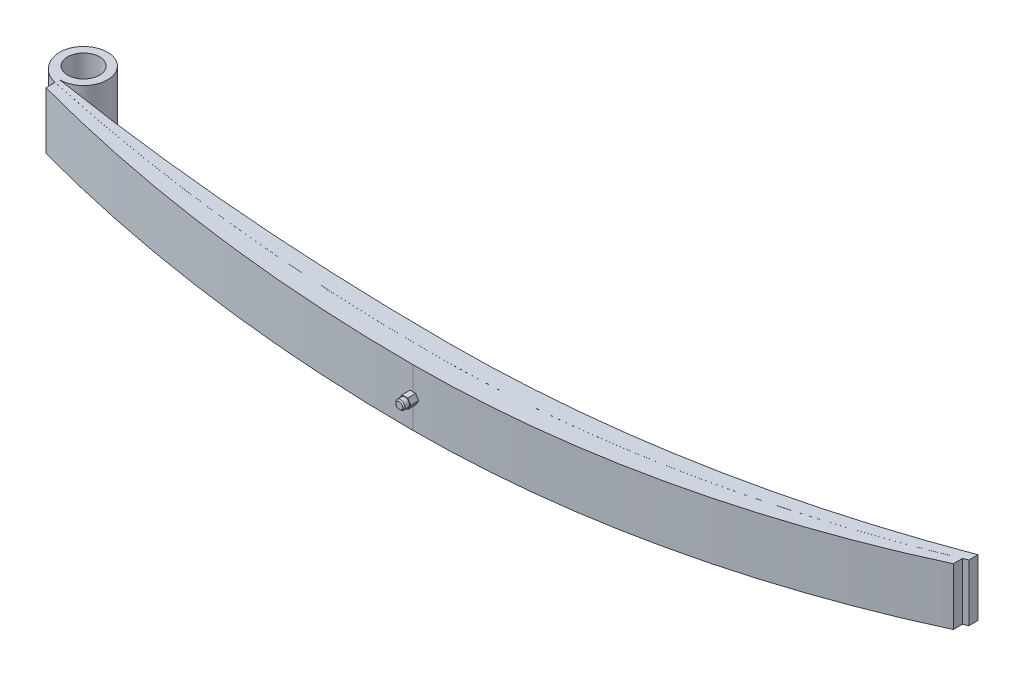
ISO-10303-21;
HEADER;
FILE_DESCRIPTION(('STEP AP214'),'2;1');
FILE_NAME('part.step','',(''),(''),'','','');
FILE_SCHEMA(('AUTOMOTIVE_DESIGN { 1 0 10303 214 1 1 1 1 }'));
ENDSEC;
DATA;
#1=APPLICATION_CONTEXT('core data for automotive mechanical design processes');
#2=APPLICATION_PROTOCOL_DEFINITION('international standard','automotive_design',2000,#1);
#3=PRODUCT_CONTEXT('',#1,'mechanical');
#4=PRODUCT('Part','Part','',(#3));
#5=PRODUCT_RELATED_PRODUCT_CATEGORY('part','',(#4));
#6=PRODUCT_DEFINITION_FORMATION('','',#4);
#7=PRODUCT_DEFINITION_CONTEXT('part definition',#1,'design');
#8=PRODUCT_DEFINITION('design','',#6,#7);
#9=PRODUCT_DEFINITION_SHAPE('','',#8);
#10=(LENGTH_UNIT() NAMED_UNIT(*) SI_UNIT(.MILLI.,.METRE.));
#11=(NAMED_UNIT(*) PLANE_ANGLE_UNIT() SI_UNIT($,.RADIAN.));
#12=(NAMED_UNIT(*) SI_UNIT($,.STERADIAN.) SOLID_ANGLE_UNIT());
#13=UNCERTAINTY_MEASURE_WITH_UNIT(LENGTH_MEASURE(1.E-05),#10,'distance_accuracy_value','');
#14=(GEOMETRIC_REPRESENTATION_CONTEXT(3) GLOBAL_UNCERTAINTY_ASSIGNED_CONTEXT((#13)) GLOBAL_UNIT_ASSIGNED_CONTEXT((#10,
#11,#12)) REPRESENTATION_CONTEXT('',''));
#15=CARTESIAN_POINT('',(0.,0.,0.));
#16=DIRECTION('',(0.,0.,1.));
#17=DIRECTION('',(1.,0.,0.));
#18=AXIS2_PLACEMENT_3D('',#15,#16,#17);
#19=CARTESIAN_POINT('',(371.499999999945,-25.,-954.999999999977));
#20=DIRECTION('',(0.,1.,0.));
#21=DIRECTION('',(0.,0.,1.));
#22=AXIS2_PLACEMENT_3D('',#19,#20,#21);
#23=CYLINDRICAL_SURFACE('',#22,1020.5);
#24=CARTESIAN_POINT('',(371.499999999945,-4.3301270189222,-954.999999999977));
#25=DIRECTION('',(0.,1.,0.));
#26=DIRECTION('',(0.,0.,1.));
#27=AXIS2_PLACEMENT_3D('',#24,#25,#26);
#28=CIRCLE('',#27,1020.5);
#29=CARTESIAN_POINT('',(371.499999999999,-4.3301270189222,65.5000000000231));
#30=VERTEX_POINT('',#29);
#31=CARTESIAN_POINT('',(374.,-4.3301270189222,65.4969377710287));
#32=VERTEX_POINT('',#31);
#33=EDGE_CURVE('E291',#30,#32,#28,.T.);
#34=ORIENTED_EDGE('',*,*,#33,.F.);
#35=DIRECTION('',(0.,1.,0.));
#36=VECTOR('',#35,1.);
#37=CARTESIAN_POINT('',(371.499999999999,-25.,65.5000000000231));
#38=LINE('',#37,#36);
#39=CARTESIAN_POINT('',(371.499999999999,-25.,65.5000000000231));
#40=VERTEX_POINT('',#39);
#41=EDGE_CURVE('E486',#40,#30,#38,.T.);
#42=ORIENTED_EDGE('',*,*,#41,.F.);
#43=CARTESIAN_POINT('',(371.499999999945,-25.,-954.999999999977));
#44=DIRECTION('',(0.,-1.,0.));
#45=DIRECTION('',(1.,0.,0.));
#46=AXIS2_PLACEMENT_3D('',#43,#44,#45);
#47=CIRCLE('',#46,1020.5);
#48=CARTESIAN_POINT('',(764.,-25.,-13.));
#49=VERTEX_POINT('',#48);
#50=EDGE_CURVE('E485',#49,#40,#47,.T.);
#51=ORIENTED_EDGE('',*,*,#50,.F.);
#52=DIRECTION('',(0.,1.,0.));
#53=VECTOR('',#52,1.);
#54=CARTESIAN_POINT('',(764.,-25.,-13.));
#55=LINE('',#54,#53);
#56=CARTESIAN_POINT('',(764.,25.,-13.));
#57=VERTEX_POINT('',#56);
#58=EDGE_CURVE('E471',#49,#57,#55,.T.);
#59=ORIENTED_EDGE('',*,*,#58,.T.);
#60=CARTESIAN_POINT('',(371.499999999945,25.,-954.999999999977));
#61=DIRECTION('',(0.,-1.,0.));
#62=DIRECTION('',(1.,0.,0.));
#63=AXIS2_PLACEMENT_3D('',#60,#61,#62);
#64=CIRCLE('',#63,1020.5);
#65=CARTESIAN_POINT('',(371.499999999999,25.,65.5000000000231));
#66=VERTEX_POINT('',#65);
#67=EDGE_CURVE('E479',#57,#66,#64,.T.);
#68=ORIENTED_EDGE('',*,*,#67,.T.);
#69=CARTESIAN_POINT('',(371.499999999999,4.33012701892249,65.5000000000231));
#70=VERTEX_POINT('',#69);
#71=EDGE_CURVE('E530',#70,#66,#38,.T.);
#72=ORIENTED_EDGE('',*,*,#71,.F.);
#73=CARTESIAN_POINT('',(371.499999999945,4.33012701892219,-954.999999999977));
#74=DIRECTION('',(0.,-1.,0.));
#75=DIRECTION('',(1.,0.,0.));
#76=AXIS2_PLACEMENT_3D('',#73,#74,#75);
#77=CIRCLE('',#76,1020.5);
#78=CARTESIAN_POINT('',(374.,4.33012701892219,65.4969377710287));
#79=VERTEX_POINT('',#78);
#80=EDGE_CURVE('E273',#79,#70,#77,.T.);
#81=ORIENTED_EDGE('',*,*,#80,.F.);
#82=CARTESIAN_POINT('',(371.499999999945,8.66025403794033,-954.999999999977));
#83=DIRECTION('',(-0.866025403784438,-0.500000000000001,0.));
#84=DIRECTION('',(-0.500000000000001,0.866025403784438,0.));
#85=AXIS2_PLACEMENT_3D('',#82,#83,#84);
#86=ELLIPSE('',#85,2041.,1020.5);
#87=CARTESIAN_POINT('',(376.5,0.,65.4877510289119));
#88=VERTEX_POINT('',#87);
#89=EDGE_CURVE('E35',#88,#79,#86,.T.);
#90=ORIENTED_EDGE('',*,*,#89,.F.);
#91=CARTESIAN_POINT('',(371.499999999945,-8.66025403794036,-954.999999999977));
#92=DIRECTION('',(-0.866025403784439,0.499999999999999,0.));
#93=DIRECTION('',(0.499999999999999,0.866025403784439,0.));
#94=AXIS2_PLACEMENT_3D('',#91,#92,#93);
#95=ELLIPSE('',#94,2041.,1020.5);
#96=EDGE_CURVE('E30',#32,#88,#95,.T.);
#97=ORIENTED_EDGE('',*,*,#96,.F.);
#98=EDGE_LOOP('',(#34,#42,#51,#59,#68,#72,#81,#90,#97));
#99=FACE_BOUND('',#98,.T.);
#100=ADVANCED_FACE('F15',(#99),#23,.T.);
#101=CARTESIAN_POINT('',(371.500000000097,-25.,-1658.60493827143));
#102=DIRECTION('',(0.,1.,0.));
#103=DIRECTION('',(0.,0.,1.));
#104=AXIS2_PLACEMENT_3D('',#101,#102,#103);
#105=CYLINDRICAL_SURFACE('',#104,1724.10493827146);
#106=CARTESIAN_POINT('',(371.500000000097,-4.3301270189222,-1658.60493827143));
#107=DIRECTION('',(0.,1.,0.));
#108=DIRECTION('',(0.,0.,1.));
#109=AXIS2_PLACEMENT_3D('',#106,#107,#108);
#110=CIRCLE('',#109,1724.10493827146);
#111=CARTESIAN_POINT('',(369.,-4.3301270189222,65.4981874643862));
#112=VERTEX_POINT('',#111);
#113=EDGE_CURVE('E288',#112,#30,#110,.T.);
#114=ORIENTED_EDGE('',*,*,#113,.F.);
#115=CARTESIAN_POINT('',(371.500000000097,-8.66025403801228,-1658.60493827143));
#116=DIRECTION('',(0.866025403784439,0.5,0.));
#117=DIRECTION('',(-0.5,0.866025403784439,0.));
#118=AXIS2_PLACEMENT_3D('',#115,#116,#117);
#119=ELLIPSE('',#118,3448.20987654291,1724.10493827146);
#120=CARTESIAN_POINT('',(366.5,0.,65.4927498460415));
#121=VERTEX_POINT('',#120);
#122=EDGE_CURVE('E296',#121,#112,#119,.T.);
#123=ORIENTED_EDGE('',*,*,#122,.F.);
#124=CARTESIAN_POINT('',(371.500000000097,8.66025403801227,-1658.60493827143));
#125=DIRECTION('',(0.866025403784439,-0.5,0.));
#126=DIRECTION('',(0.5,0.866025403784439,0.));
#127=AXIS2_PLACEMENT_3D('',#124,#125,#126);
#128=ELLIPSE('',#127,3448.20987654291,1724.10493827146);
#129=CARTESIAN_POINT('',(369.,4.33012701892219,65.4981874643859));
#130=VERTEX_POINT('',#129);
#131=EDGE_CURVE('E302',#130,#121,#128,.T.);
#132=ORIENTED_EDGE('',*,*,#131,.F.);
#133=CARTESIAN_POINT('',(371.500000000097,4.33012701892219,-1658.60493827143));
#134=DIRECTION('',(0.,-1.,0.));
#135=DIRECTION('',(1.,0.,0.));
#136=AXIS2_PLACEMENT_3D('',#133,#134,#135);
#137=CIRCLE('',#136,1724.10493827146);
#138=EDGE_CURVE('E270',#70,#130,#137,.T.);
#139=ORIENTED_EDGE('',*,*,#138,.F.);
#140=ORIENTED_EDGE('',*,*,#71,.T.);
#141=CARTESIAN_POINT('',(371.500000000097,25.,-1658.60493827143));
#142=DIRECTION('',(0.,-1.,0.));
#143=DIRECTION('',(1.,0.,0.));
#144=AXIS2_PLACEMENT_3D('',#141,#142,#143);
#145=CIRCLE('',#144,1724.10493827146);
#146=CARTESIAN_POINT('',(0.111059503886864,25.,25.0245022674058));
#147=VERTEX_POINT('',#146);
#148=EDGE_CURVE('E491',#66,#147,#145,.T.);
#149=ORIENTED_EDGE('',*,*,#148,.T.);
#150=DIRECTION('',(0.,1.,0.));
#151=VECTOR('',#150,1.);
#152=CARTESIAN_POINT('',(0.111059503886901,-25.,25.0245022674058));
#153=LINE('',#152,#151);
#154=CARTESIAN_POINT('',(0.111059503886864,-25.,25.0245022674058));
#155=VERTEX_POINT('',#154);
#156=EDGE_CURVE('E396',#147,#155,#153,.F.);
#157=ORIENTED_EDGE('',*,*,#156,.T.);
#158=CARTESIAN_POINT('',(371.500000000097,-25.,-1658.60493827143));
#159=DIRECTION('',(0.,-1.,0.));
#160=DIRECTION('',(1.,0.,0.));
#161=AXIS2_PLACEMENT_3D('',#158,#159,#160);
#162=CIRCLE('',#161,1724.10493827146);
#163=EDGE_CURVE('E693',#40,#155,#162,.T.);
#164=ORIENTED_EDGE('',*,*,#163,.F.);
#165=ORIENTED_EDGE('',*,*,#41,.T.);
#166=EDGE_LOOP('',(#114,#123,#132,#139,#140,#149,#157,#164,#165));
#167=FACE_BOUND('',#166,.T.);
#168=ADVANCED_FACE('F456',(#167),#105,.T.);
#169=CARTESIAN_POINT('',(371.500000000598,25.,-1658.60493827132));
#170=DIRECTION('',(0.,-1.,0.));
#171=DIRECTION('',(0.,0.,-1.));
#172=AXIS2_PLACEMENT_3D('',#169,#170,#171);
#173=CYLINDRICAL_SURFACE('',#172,1724.15493827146);
#174=CARTESIAN_POINT('',(371.500000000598,-8.66025403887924,-1658.60493827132));
#175=DIRECTION('',(0.866025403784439,0.5,0.));
#176=DIRECTION('',(0.5,-0.866025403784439,0.));
#177=AXIS2_PLACEMENT_3D('',#174,#175,#176);
#178=ELLIPSE('',#177,3448.30987654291,1724.15493827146);
#179=CARTESIAN_POINT('',(366.5,0.,65.542750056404));
#180=VERTEX_POINT('',#179);
#181=CARTESIAN_POINT('',(369.,-4.3301270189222,65.5481875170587));
#182=VERTEX_POINT('',#181);
#183=EDGE_CURVE('E293',#180,#182,#178,.T.);
#184=ORIENTED_EDGE('',*,*,#183,.T.);
#185=CARTESIAN_POINT('',(371.500000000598,-4.3301270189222,-1658.60493827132));
#186=DIRECTION('',(0.,1.,0.));
#187=DIRECTION('',(0.,0.,1.));
#188=AXIS2_PLACEMENT_3D('',#185,#186,#187);
#189=CIRCLE('',#188,1724.15493827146);
#190=CARTESIAN_POINT('',(371.500000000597,-4.3301270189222,65.5500000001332));
#191=VERTEX_POINT('',#190);
#192=EDGE_CURVE('E285',#182,#191,#189,.T.);
#193=ORIENTED_EDGE('',*,*,#192,.T.);
#194=DIRECTION('',(0.,-1.,0.));
#195=VECTOR('',#194,1.);
#196=CARTESIAN_POINT('',(371.500000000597,25.,65.5500000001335));
#197=LINE('',#196,#195);
#198=CARTESIAN_POINT('',(371.500000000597,-25.,65.5500000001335));
#199=VERTEX_POINT('',#198);
#200=EDGE_CURVE('E387',#191,#199,#197,.T.);
#201=ORIENTED_EDGE('',*,*,#200,.T.);
#202=CARTESIAN_POINT('',(371.500000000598,-25.,-1658.60493827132));
#203=DIRECTION('',(0.,1.,0.));
#204=DIRECTION('',(0.,0.,-1.));
#205=AXIS2_PLACEMENT_3D('',#202,#203,#204);
#206=CIRCLE('',#205,1724.15493827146);
#207=CARTESIAN_POINT('',(0.450328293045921,-25.,25.1505048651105));
#208=VERTEX_POINT('',#207);
#209=EDGE_CURVE('E348',#208,#199,#206,.T.);
#210=ORIENTED_EDGE('',*,*,#209,.F.);
#211=DIRECTION('',(0.,-1.,0.));
#212=VECTOR('',#211,1.);
#213=CARTESIAN_POINT('',(0.450328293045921,25.,25.1505048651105));
#214=LINE('',#213,#212);
#215=CARTESIAN_POINT('',(0.450328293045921,25.,25.1505048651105));
#216=VERTEX_POINT('',#215);
#217=EDGE_CURVE('E391',#216,#208,#214,.T.);
#218=ORIENTED_EDGE('',*,*,#217,.F.);
#219=CARTESIAN_POINT('',(371.500000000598,25.,-1658.60493827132));
#220=DIRECTION('',(0.,1.,0.));
#221=DIRECTION('',(0.,0.,-1.));
#222=AXIS2_PLACEMENT_3D('',#219,#220,#221);
#223=CIRCLE('',#222,1724.15493827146);
#224=CARTESIAN_POINT('',(371.500000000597,25.,65.5500000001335));
#225=VERTEX_POINT('',#224);
#226=EDGE_CURVE('E320',#216,#225,#223,.T.);
#227=ORIENTED_EDGE('',*,*,#226,.T.);
#228=CARTESIAN_POINT('',(371.500000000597,4.33012701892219,65.5500000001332));
#229=VERTEX_POINT('',#228);
#230=EDGE_CURVE('E388',#225,#229,#197,.T.);
#231=ORIENTED_EDGE('',*,*,#230,.T.);
#232=CARTESIAN_POINT('',(371.500000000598,4.33012701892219,-1658.60493827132));
#233=DIRECTION('',(0.,-1.,0.));
#234=DIRECTION('',(1.,0.,0.));
#235=AXIS2_PLACEMENT_3D('',#232,#233,#234);
#236=CIRCLE('',#235,1724.15493827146);
#237=CARTESIAN_POINT('',(369.,4.33012701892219,65.5481875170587));
#238=VERTEX_POINT('',#237);
#239=EDGE_CURVE('E267',#229,#238,#236,.T.);
#240=ORIENTED_EDGE('',*,*,#239,.T.);
#241=CARTESIAN_POINT('',(371.500000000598,8.66025403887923,-1658.60493827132));
#242=DIRECTION('',(0.866025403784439,-0.5,0.));
#243=DIRECTION('',(-0.5,-0.866025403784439,0.));
#244=AXIS2_PLACEMENT_3D('',#241,#242,#243);
#245=ELLIPSE('',#244,3448.30987654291,1724.15493827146);
#246=EDGE_CURVE('E299',#238,#180,#245,.T.);
#247=ORIENTED_EDGE('',*,*,#246,.T.);
#248=EDGE_LOOP('',(#184,#193,#201,#210,#218,#227,#231,#240,#247));
#249=FACE_BOUND('',#248,.T.);
#250=ADVANCED_FACE('F459',(#249),#173,.F.);
#251=CARTESIAN_POINT('',(371.499999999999,25.,65.5500000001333));
#252=DIRECTION('',(-0.000265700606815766,0.,-0.999999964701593));
#253=DIRECTION('',(-0.999999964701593,0.,0.000265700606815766));
#254=AXIS2_PLACEMENT_3D('',#251,#252,#253);
#255=PLANE('',#254);
#256=ORIENTED_EDGE('',*,*,#200,.F.);
#257=DIRECTION('',(0.999999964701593,0.,-0.000265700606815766));
#258=VECTOR('',#257,1.);
#259=CARTESIAN_POINT('',(371.499999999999,-4.3301270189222,65.5500000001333));
#260=LINE('',#259,#258);
#261=CARTESIAN_POINT('',(372.042321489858,-4.3301270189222,65.5498559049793));
#262=VERTEX_POINT('',#261);
#263=EDGE_CURVE('E282',#191,#262,#260,.T.);
#264=ORIENTED_EDGE('',*,*,#263,.T.);
#265=DIRECTION('',(0.,-1.,0.));
#266=VECTOR('',#265,1.);
#267=CARTESIAN_POINT('',(372.042321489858,25.,65.5498559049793));
#268=LINE('',#267,#266);
#269=CARTESIAN_POINT('',(372.042321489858,-25.,65.5498559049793));
#270=VERTEX_POINT('',#269);
#271=EDGE_CURVE('E383',#262,#270,#268,.T.);
#272=ORIENTED_EDGE('',*,*,#271,.T.);
#273=DIRECTION('',(0.999999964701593,0.,-0.000265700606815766));
#274=VECTOR('',#273,1.);
#275=CARTESIAN_POINT('',(371.499999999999,-25.,65.5500000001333));
#276=LINE('',#275,#274);
#277=EDGE_CURVE('E352',#199,#270,#276,.T.);
#278=ORIENTED_EDGE('',*,*,#277,.F.);
#279=EDGE_LOOP('',(#256,#264,#272,#278));
#280=FACE_BOUND('',#279,.T.);
#281=ADVANCED_FACE('F575',(#280),#255,.T.);
#282=CARTESIAN_POINT('',(372.042321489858,25.,65.5498559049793));
#283=VERTEX_POINT('',#282);
#284=CARTESIAN_POINT('',(372.042321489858,4.33012701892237,65.5498559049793));
#285=VERTEX_POINT('',#284);
#286=EDGE_CURVE('E384',#283,#285,#268,.T.);
#287=ORIENTED_EDGE('',*,*,#286,.T.);
#288=DIRECTION('',(-0.999999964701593,0.,0.000265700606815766));
#289=VECTOR('',#288,1.);
#290=CARTESIAN_POINT('',(371.499999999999,4.33012701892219,65.5500000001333));
#291=LINE('',#290,#289);
#292=EDGE_CURVE('E264',#285,#229,#291,.T.);
#293=ORIENTED_EDGE('',*,*,#292,.T.);
#294=ORIENTED_EDGE('',*,*,#230,.F.);
#295=DIRECTION('',(0.999999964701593,0.,-0.000265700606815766));
#296=VECTOR('',#295,1.);
#297=CARTESIAN_POINT('',(371.499999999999,25.,65.5500000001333));
#298=LINE('',#297,#296);
#299=EDGE_CURVE('E323',#225,#283,#298,.T.);
#300=ORIENTED_EDGE('',*,*,#299,.T.);
#301=EDGE_LOOP('',(#287,#293,#294,#300));
#302=FACE_BOUND('',#301,.T.);
#303=ADVANCED_FACE('F667',(#302),#255,.T.);
#304=CARTESIAN_POINT('',(371.499999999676,25.,-954.999999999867));
#305=DIRECTION('',(0.,-1.,0.));
#306=DIRECTION('',(0.,0.,-1.));
#307=AXIS2_PLACEMENT_3D('',#304,#305,#306);
#308=CYLINDRICAL_SURFACE('',#307,1020.55);
#309=ORIENTED_EDGE('',*,*,#271,.F.);
#310=CARTESIAN_POINT('',(371.499999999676,-4.3301270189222,-954.999999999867));
#311=DIRECTION('',(0.,1.,0.));
#312=DIRECTION('',(0.,0.,1.));
#313=AXIS2_PLACEMENT_3D('',#310,#311,#312);
#314=CIRCLE('',#313,1020.55);
#315=CARTESIAN_POINT('',(374.,-4.3301270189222,65.5469379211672));
#316=VERTEX_POINT('',#315);
#317=EDGE_CURVE('E279',#262,#316,#314,.T.);
#318=ORIENTED_EDGE('',*,*,#317,.T.);
#319=CARTESIAN_POINT('',(371.499999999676,-8.66025403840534,-954.999999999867));
#320=DIRECTION('',(-0.866025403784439,0.499999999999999,0.));
#321=DIRECTION('',(-0.499999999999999,-0.866025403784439,0.));
#322=AXIS2_PLACEMENT_3D('',#319,#320,#321);
#323=ELLIPSE('',#322,2041.1,1020.55);
#324=CARTESIAN_POINT('',(376.5,0.,65.5377516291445));
#325=VERTEX_POINT('',#324);
#326=EDGE_CURVE('E309',#316,#325,#323,.T.);
#327=ORIENTED_EDGE('',*,*,#326,.T.);
#328=CARTESIAN_POINT('',(371.499999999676,8.6602540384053,-954.999999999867));
#329=DIRECTION('',(-0.866025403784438,-0.500000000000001,0.));
#330=DIRECTION('',(0.500000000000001,-0.866025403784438,0.));
#331=AXIS2_PLACEMENT_3D('',#328,#329,#330);
#332=ELLIPSE('',#331,2041.1,1020.55);
#333=CARTESIAN_POINT('',(374.,4.33012701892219,65.5469379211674));
#334=VERTEX_POINT('',#333);
#335=EDGE_CURVE('E305',#325,#334,#332,.T.);
#336=ORIENTED_EDGE('',*,*,#335,.T.);
#337=CARTESIAN_POINT('',(371.499999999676,4.33012701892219,-954.999999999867));
#338=DIRECTION('',(0.,-1.,0.));
#339=DIRECTION('',(1.,0.,0.));
#340=AXIS2_PLACEMENT_3D('',#337,#338,#339);
#341=CIRCLE('',#340,1020.55);
#342=EDGE_CURVE('E256',#334,#285,#341,.T.);
#343=ORIENTED_EDGE('',*,*,#342,.T.);
#344=ORIENTED_EDGE('',*,*,#286,.F.);
#345=CARTESIAN_POINT('',(371.499999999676,25.,-954.999999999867));
#346=DIRECTION('',(0.,1.,0.));
#347=DIRECTION('',(0.,0.,1.));
#348=AXIS2_PLACEMENT_3D('',#345,#346,#347);
#349=CIRCLE('',#348,1020.55);
#350=CARTESIAN_POINT('',(760.,25.,-11.2892114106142));
#351=VERTEX_POINT('',#350);
#352=EDGE_CURVE('E326',#283,#351,#349,.T.);
#353=ORIENTED_EDGE('',*,*,#352,.T.);
#354=DIRECTION('',(0.,-1.,0.));
#355=VECTOR('',#354,1.);
#356=CARTESIAN_POINT('',(760.,25.,-11.2892114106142));
#357=LINE('',#356,#355);
#358=CARTESIAN_POINT('',(760.,-25.,-11.2892114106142));
#359=VERTEX_POINT('',#358);
#360=EDGE_CURVE('E381',#351,#359,#357,.T.);
#361=ORIENTED_EDGE('',*,*,#360,.T.);
#362=CARTESIAN_POINT('',(371.499999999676,-25.,-954.999999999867));
#363=DIRECTION('',(0.,1.,0.));
#364=DIRECTION('',(0.,0.,1.));
#365=AXIS2_PLACEMENT_3D('',#362,#363,#364);
#366=CIRCLE('',#365,1020.55);
#367=EDGE_CURVE('E356',#270,#359,#366,.T.);
#368=ORIENTED_EDGE('',*,*,#367,.F.);
#369=EDGE_LOOP('',(#309,#318,#327,#336,#343,#344,#353,#361,#368));
#370=FACE_BOUND('',#369,.T.);
#371=ADVANCED_FACE('F570',(#370),#308,.F.);
#372=CARTESIAN_POINT('',(371.499999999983,25.,-840.063782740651));
#373=DIRECTION('',(0.,-1.,0.));
#374=DIRECTION('',(0.,0.,-1.));
#375=AXIS2_PLACEMENT_3D('',#372,#373,#374);
#376=CYLINDRICAL_SURFACE('',#375,922.563782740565);
#377=CARTESIAN_POINT('',(371.499999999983,-8.66025403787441,-840.063782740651));
#378=DIRECTION('',(-0.866025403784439,0.499999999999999,0.));
#379=DIRECTION('',(-0.499999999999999,-0.866025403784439,0.));
#380=AXIS2_PLACEMENT_3D('',#377,#378,#379);
#381=ELLIPSE('',#380,1845.12756548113,922.563782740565);
#382=CARTESIAN_POINT('',(376.5,0.,82.4864507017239));
#383=VERTEX_POINT('',#382);
#384=CARTESIAN_POINT('',(374.,-4.3301270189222,82.4966126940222));
#385=VERTEX_POINT('',#384);
#386=EDGE_CURVE('E595',#383,#385,#381,.F.);
#387=ORIENTED_EDGE('',*,*,#386,.T.);
#388=CARTESIAN_POINT('',(371.499999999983,-4.3301270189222,-840.063782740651));
#389=DIRECTION('',(0.,1.,0.));
#390=DIRECTION('',(0.,0.,1.));
#391=AXIS2_PLACEMENT_3D('',#388,#389,#390);
#392=CIRCLE('',#391,922.563782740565);
#393=CARTESIAN_POINT('',(371.5,-4.3301270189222,82.4999999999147));
#394=VERTEX_POINT('',#393);
#395=EDGE_CURVE('E276',#385,#394,#392,.F.);
#396=ORIENTED_EDGE('',*,*,#395,.T.);
#397=DIRECTION('',(0.,-1.,0.));
#398=VECTOR('',#397,1.);
#399=CARTESIAN_POINT('',(371.499999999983,25.,82.4999999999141));
#400=LINE('',#399,#398);
#401=CARTESIAN_POINT('',(371.499999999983,-25.,82.4999999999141));
#402=VERTEX_POINT('',#401);
#403=EDGE_CURVE('E375',#394,#402,#400,.T.);
#404=ORIENTED_EDGE('',*,*,#403,.T.);
#405=CARTESIAN_POINT('',(371.499999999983,-25.,-840.063782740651));
#406=DIRECTION('',(0.,-1.,0.));
#407=DIRECTION('',(0.,0.,-1.));
#408=AXIS2_PLACEMENT_3D('',#405,#406,#407);
#409=CIRCLE('',#408,922.563782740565);
#410=CARTESIAN_POINT('',(760.,-25.,-3.289211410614));
#411=VERTEX_POINT('',#410);
#412=EDGE_CURVE('E364',#411,#402,#409,.T.);
#413=ORIENTED_EDGE('',*,*,#412,.F.);
#414=DIRECTION('',(0.,-1.,0.));
#415=VECTOR('',#414,1.);
#416=CARTESIAN_POINT('',(760.,25.,-3.289211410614));
#417=LINE('',#416,#415);
#418=CARTESIAN_POINT('',(760.,25.,-3.289211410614));
#419=VERTEX_POINT('',#418);
#420=EDGE_CURVE('E379',#419,#411,#417,.T.);
#421=ORIENTED_EDGE('',*,*,#420,.F.);
#422=CARTESIAN_POINT('',(371.499999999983,25.,-840.063782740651));
#423=DIRECTION('',(0.,-1.,0.));
#424=DIRECTION('',(0.,0.,-1.));
#425=AXIS2_PLACEMENT_3D('',#422,#423,#424);
#426=CIRCLE('',#425,922.563782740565);
#427=CARTESIAN_POINT('',(371.499999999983,25.,82.4999999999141));
#428=VERTEX_POINT('',#427);
#429=EDGE_CURVE('E332',#419,#428,#426,.T.);
#430=ORIENTED_EDGE('',*,*,#429,.T.);
#431=CARTESIAN_POINT('',(371.499999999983,4.33012701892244,82.4999999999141));
#432=VERTEX_POINT('',#431);
#433=EDGE_CURVE('E376',#428,#432,#400,.T.);
#434=ORIENTED_EDGE('',*,*,#433,.T.);
#435=CARTESIAN_POINT('',(371.499999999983,4.33012701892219,-840.063782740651));
#436=DIRECTION('',(0.,-1.,0.));
#437=DIRECTION('',(1.,0.,0.));
#438=AXIS2_PLACEMENT_3D('',#435,#436,#437);
#439=CIRCLE('',#438,922.563782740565);
#440=CARTESIAN_POINT('',(374.,4.33012701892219,82.4966126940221));
#441=VERTEX_POINT('',#440);
#442=EDGE_CURVE('E252',#432,#441,#439,.F.);
#443=ORIENTED_EDGE('',*,*,#442,.T.);
#444=CARTESIAN_POINT('',(371.499999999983,8.66025403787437,-840.063782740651));
#445=DIRECTION('',(-0.866025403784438,-0.500000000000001,0.));
#446=DIRECTION('',(0.500000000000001,-0.866025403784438,0.));
#447=AXIS2_PLACEMENT_3D('',#444,#445,#446);
#448=ELLIPSE('',#447,1845.12756548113,922.563782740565);
#449=EDGE_CURVE('E600',#441,#383,#448,.F.);
#450=ORIENTED_EDGE('',*,*,#449,.T.);
#451=EDGE_LOOP('',(#387,#396,#404,#413,#421,#430,#434,#443,#450));
#452=FACE_BOUND('',#451,.T.);
#453=ADVANCED_FACE('F657',(#452),#376,.T.);
#454=CARTESIAN_POINT('',(371.5,25.,-1336.36393541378));
#455=DIRECTION('',(0.,-1.,0.));
#456=DIRECTION('',(0.,0.,-1.));
#457=AXIS2_PLACEMENT_3D('',#454,#455,#456);
#458=CYLINDRICAL_SURFACE('',#457,1418.86393541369);
#459=ORIENTED_EDGE('',*,*,#403,.F.);
#460=CARTESIAN_POINT('',(371.5,-4.3301270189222,-1336.36393541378));
#461=DIRECTION('',(0.,1.,0.));
#462=DIRECTION('',(0.,0.,1.));
#463=AXIS2_PLACEMENT_3D('',#460,#461,#462);
#464=CIRCLE('',#463,1418.86393541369);
#465=CARTESIAN_POINT('',(369.,-4.3301270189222,82.4977975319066));
#466=VERTEX_POINT('',#465);
#467=EDGE_CURVE('E609',#394,#466,#464,.F.);
#468=ORIENTED_EDGE('',*,*,#467,.T.);
#469=CARTESIAN_POINT('',(371.5,-8.66025403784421,-1336.36393541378));
#470=DIRECTION('',(0.866025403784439,0.5,0.));
#471=DIRECTION('',(0.5,-0.866025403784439,0.));
#472=AXIS2_PLACEMENT_3D('',#469,#470,#471);
#473=ELLIPSE('',#472,2837.72787082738,1418.86393541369);
#474=CARTESIAN_POINT('',(366.5,0.,82.4911901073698));
#475=VERTEX_POINT('',#474);
#476=EDGE_CURVE('E608',#466,#475,#473,.F.);
#477=ORIENTED_EDGE('',*,*,#476,.T.);
#478=CARTESIAN_POINT('',(371.5,8.6602540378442,-1336.36393541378));
#479=DIRECTION('',(0.866025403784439,-0.5,0.));
#480=DIRECTION('',(-0.5,-0.866025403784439,0.));
#481=AXIS2_PLACEMENT_3D('',#478,#479,#480);
#482=ELLIPSE('',#481,2837.72787082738,1418.86393541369);
#483=CARTESIAN_POINT('',(369.,4.33012701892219,82.4977975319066));
#484=VERTEX_POINT('',#483);
#485=EDGE_CURVE('E251',#475,#484,#482,.F.);
#486=ORIENTED_EDGE('',*,*,#485,.T.);
#487=CARTESIAN_POINT('',(371.5,4.33012701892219,-1336.36393541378));
#488=DIRECTION('',(0.,-1.,0.));
#489=DIRECTION('',(1.,0.,0.));
#490=AXIS2_PLACEMENT_3D('',#487,#488,#489);
#491=CIRCLE('',#490,1418.86393541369);
#492=EDGE_CURVE('E436',#484,#432,#491,.F.);
#493=ORIENTED_EDGE('',*,*,#492,.T.);
#494=ORIENTED_EDGE('',*,*,#433,.F.);
#495=CARTESIAN_POINT('',(371.5,25.,-1336.36393541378));
#496=DIRECTION('',(0.,-1.,0.));
#497=DIRECTION('',(0.,0.,-1.));
#498=AXIS2_PLACEMENT_3D('',#495,#496,#497);
#499=CIRCLE('',#498,1418.86393541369);
#500=CARTESIAN_POINT('',(-1.72084568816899E-12,25.,33.0018364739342));
#501=VERTEX_POINT('',#500);
#502=EDGE_CURVE('E335',#428,#501,#499,.T.);
#503=ORIENTED_EDGE('',*,*,#502,.T.);
#504=DIRECTION('',(0.,-1.,0.));
#505=VECTOR('',#504,1.);
#506=CARTESIAN_POINT('',(-1.72084568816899E-12,25.,33.0018364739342));
#507=LINE('',#506,#505);
#508=CARTESIAN_POINT('',(-1.72084568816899E-12,-25.,33.0018364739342));
#509=VERTEX_POINT('',#508);
#510=EDGE_CURVE('E338',#501,#509,#507,.T.);
#511=ORIENTED_EDGE('',*,*,#510,.T.);
#512=CARTESIAN_POINT('',(371.5,-25.,-1336.36393541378));
#513=DIRECTION('',(0.,-1.,0.));
#514=DIRECTION('',(0.,0.,-1.));
#515=AXIS2_PLACEMENT_3D('',#512,#513,#514);
#516=CIRCLE('',#515,1418.86393541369);
#517=EDGE_CURVE('E340',#402,#509,#516,.T.);
#518=ORIENTED_EDGE('',*,*,#517,.F.);
#519=EDGE_LOOP('',(#459,#468,#477,#486,#493,#494,#503,#511,#518));
#520=FACE_BOUND('',#519,.T.);
#521=ADVANCED_FACE('F606',(#520),#458,.T.);
#522=CARTESIAN_POINT('',(371.5,-25.,-1062.56643356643));
#523=DIRECTION('',(0.,1.,0.));
#524=DIRECTION('',(0.,0.,1.));
#525=AXIS2_PLACEMENT_3D('',#522,#523,#524);
#526=CYLINDRICAL_SURFACE('',#525,1113.06643356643);
#527=CARTESIAN_POINT('',(371.499999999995,6.,50.5));
#528=CARTESIAN_POINT('',(371.668750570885,6.00001814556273,50.5000003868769));
#529=CARTESIAN_POINT('',(371.83749853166,5.99288157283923,50.4999616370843));
#530=CARTESIAN_POINT('',(372.173787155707,5.96443005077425,50.4998086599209));
#531=CARTESIAN_POINT('',(372.341327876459,5.94311578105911,50.4996944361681));
#532=CARTESIAN_POINT('',(372.673899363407,5.88645983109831,50.4993934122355));
#533=CARTESIAN_POINT('',(372.838931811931,5.85112802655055,50.4992066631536));
#534=CARTESIAN_POINT('',(373.165433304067,5.76669406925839,50.4987660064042));
#535=CARTESIAN_POINT('',(373.326902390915,5.7175920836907,50.4985120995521));
#536=CARTESIAN_POINT('',(373.645177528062,5.60594893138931,50.4979442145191));
#537=CARTESIAN_POINT('',(373.801982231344,5.54340392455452,50.4976302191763));
#538=CARTESIAN_POINT('',(374.109822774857,5.40530246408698,50.4969509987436));
#539=CARTESIAN_POINT('',(374.260856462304,5.32974121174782,50.496585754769));
#540=CARTESIAN_POINT('',(374.555935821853,5.1662069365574,50.495814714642));
#541=CARTESIAN_POINT('',(374.699985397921,5.07824095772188,50.4954089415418));
#542=CARTESIAN_POINT('',(374.980216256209,4.89045533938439,50.4945680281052));
#543=CARTESIAN_POINT('',(375.116394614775,4.79063133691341,50.4941328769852));
#544=CARTESIAN_POINT('',(375.379812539,4.57990110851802,50.4932458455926));
#545=CARTESIAN_POINT('',(375.507055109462,4.46899863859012,50.4927939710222));
#546=CARTESIAN_POINT('',(375.751793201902,4.23682840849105,50.4918860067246));
#547=CARTESIAN_POINT('',(375.869285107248,4.11555683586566,50.4914299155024));
#548=CARTESIAN_POINT('',(376.093609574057,3.86357337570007,50.4905267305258));
#549=CARTESIAN_POINT('',(376.20044443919,3.73286353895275,50.4900796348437));
#550=CARTESIAN_POINT('',(376.402761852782,3.46285942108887,50.4892068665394));
#551=CARTESIAN_POINT('',(376.49824019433,3.32356198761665,50.4887812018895));
#552=CARTESIAN_POINT('',(376.677083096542,3.03747534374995,50.4879637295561));
#553=CARTESIAN_POINT('',(376.760452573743,2.89068920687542,50.4875719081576));
#554=CARTESIAN_POINT('',(376.914560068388,2.59056111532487,50.4868329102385));
#555=CARTESIAN_POINT('',(376.985293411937,2.43721676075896,50.4864857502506));
#556=CARTESIAN_POINT('',(377.113559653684,2.12517960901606,50.4858462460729));
#557=CARTESIAN_POINT('',(377.171098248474,1.96648915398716,50.4855538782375));
#558=CARTESIAN_POINT('',(377.272624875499,1.64477116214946,50.4850319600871));
#559=CARTESIAN_POINT('',(377.316607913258,1.48174205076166,50.4848024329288));
#560=CARTESIAN_POINT('',(377.390665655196,1.15259764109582,50.4844129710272));
#561=CARTESIAN_POINT('',(377.42074518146,0.986483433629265,50.484253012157));
#562=CARTESIAN_POINT('',(377.466825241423,0.652317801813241,50.4840068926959));
#563=CARTESIAN_POINT('',(377.482820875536,0.48426572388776,50.4839207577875));
#564=CARTESIAN_POINT('',(377.509402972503,-0.021025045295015,50.4837779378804));
#565=CARTESIAN_POINT('',(377.498662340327,-0.359744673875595,50.4838364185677));
#566=CARTESIAN_POINT('',(377.440120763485,-0.862336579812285,50.4841495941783));
#567=CARTESIAN_POINT('',(377.413510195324,-1.02903803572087,50.4842916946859));
#568=CARTESIAN_POINT('',(377.346351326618,-1.35961368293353,50.4846465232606));
#569=CARTESIAN_POINT('',(377.305807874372,-1.52348883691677,50.4848592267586));
#570=CARTESIAN_POINT('',(377.21104517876,-1.84728196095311,50.4853494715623));
#571=CARTESIAN_POINT('',(377.156821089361,-2.00719850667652,50.4856270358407));
#572=CARTESIAN_POINT('',(377.035114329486,-2.32184083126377,50.4862389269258));
#573=CARTESIAN_POINT('',(376.967636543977,-2.47656849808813,50.4865732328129));
#574=CARTESIAN_POINT('',(376.819859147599,-2.77985012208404,50.4872893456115));
#575=CARTESIAN_POINT('',(376.73955441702,-2.92840158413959,50.4876711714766));
#576=CARTESIAN_POINT('',(376.566745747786,-3.21815655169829,50.4884712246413));
#577=CARTESIAN_POINT('',(376.474246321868,-3.35936274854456,50.488889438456));
#578=CARTESIAN_POINT('',(376.277651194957,-3.63352612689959,50.4897506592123));
#579=CARTESIAN_POINT('',(376.173551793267,-3.76648065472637,50.4901936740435));
#580=CARTESIAN_POINT('',(375.954561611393,-4.02309864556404,50.4910916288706));
#581=CARTESIAN_POINT('',(375.839674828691,-4.14676551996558,50.4915465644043));
#582=CARTESIAN_POINT('',(375.599864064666,-4.38401306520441,50.492455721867));
#583=CARTESIAN_POINT('',(375.47493760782,-4.49759123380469,50.4929099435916));
#584=CARTESIAN_POINT('',(375.216008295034,-4.71377951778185,50.4938045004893));
#585=CARTESIAN_POINT('',(375.082008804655,-4.81639366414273,50.4942448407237));
#586=CARTESIAN_POINT('',(374.805749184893,-5.01003955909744,50.4950996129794));
#587=CARTESIAN_POINT('',(374.663483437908,-5.10106329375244,50.4955140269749));
#588=CARTESIAN_POINT('',(374.371841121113,-5.27076670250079,50.4963046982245));
#589=CARTESIAN_POINT('',(374.222467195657,-5.34945092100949,50.4966809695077));
#590=CARTESIAN_POINT('',(373.917472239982,-5.49402742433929,50.497385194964));
#591=CARTESIAN_POINT('',(373.761845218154,-5.559907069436,50.4977131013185));
#592=CARTESIAN_POINT('',(373.445648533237,-5.67828657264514,50.498310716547));
#593=CARTESIAN_POINT('',(373.285080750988,-5.7307914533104,50.4985804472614));
#594=CARTESIAN_POINT('',(372.960274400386,-5.82202941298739,50.4990539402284));
#595=CARTESIAN_POINT('',(372.796040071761,-5.86077760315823,50.499257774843));
#596=CARTESIAN_POINT('',(372.464957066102,-5.92429312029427,50.4995940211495));
#597=CARTESIAN_POINT('',(372.298109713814,-5.94906731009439,50.4997264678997));
#598=CARTESIAN_POINT('',(372.025749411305,-5.97785069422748,50.4998807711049));
#599=CARTESIAN_POINT('',(371.920672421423,-5.98616197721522,50.4999254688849));
#600=CARTESIAN_POINT('',(371.710400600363,-5.99723265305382,50.4999850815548));
#601=CARTESIAN_POINT('',(371.605206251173,-6.00000120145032,50.5000000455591));
#602=CARTESIAN_POINT('',(371.499999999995,-6.,50.4999999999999));
#603=B_SPLINE_CURVE_WITH_KNOTS('',3,(#527,#528,#529,#530,#531,#532,#533,#534,#535,#536,#537,
#538,#539,#540,#541,#542,#543,#544,#545,#546,#547,#548,#549,#550,#551,#552,#553,#554,#555,#556,
#557,#558,#559,#560,#561,#562,#563,#564,#565,#566,#567,#568,#569,#570,#571,#572,#573,#574,#575,
#576,#577,#578,#579,#580,#581,#582,#583,#584,#585,#586,#587,#588,#589,#590,#591,#592,#593,#594,
#595,#596,#597,#598,#599,#600,#601,#602),.UNSPECIFIED.,.F.,.F.,(4,2,2,2,2,2,2,2,2,2,2,2,2,2,2,2,
2,2,2,2,2,2,2,2,2,2,2,2,2,2,2,2,2,2,2,2,2,4),(0.,0.506097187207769,1.01217011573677,
1.51788713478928,2.02359801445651,2.52945354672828,3.03549597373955,3.54125219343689,
4.04719507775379,4.55296700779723,5.05892570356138,5.56477479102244,6.07081068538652,
6.57664053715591,7.08265710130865,7.58845478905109,8.0944386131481,8.60024681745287,
9.10623091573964,10.1171468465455,10.6231322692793,11.1289417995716,11.6349307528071,
12.1407335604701,12.6467387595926,13.1525572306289,13.6585375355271,14.164331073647,
14.670249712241,15.1759817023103,15.6820614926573,16.1879544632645,16.6943443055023,
17.2005437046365,17.7061853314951,18.2115784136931,18.527659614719,18.8432182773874),.UNSPECIFIED.);
#604=CARTESIAN_POINT('',(371.499999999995,6.,50.5000000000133));
#605=VERTEX_POINT('',#604);
#606=CARTESIAN_POINT('',(371.499999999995,-6.,50.5000000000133));
#607=VERTEX_POINT('',#606);
#608=EDGE_CURVE('E402',#605,#607,#603,.T.);
#609=ORIENTED_EDGE('',*,*,#608,.F.);
#610=DIRECTION('',(0.,1.,0.));
#611=VECTOR('',#610,1.);
#612=CARTESIAN_POINT('',(371.499999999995,-25.,50.5000000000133));
#613=LINE('',#612,#611);
#614=CARTESIAN_POINT('',(371.499999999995,25.,50.5000000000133));
#615=VERTEX_POINT('',#614);
#616=EDGE_CURVE('E521',#605,#615,#613,.T.);
#617=ORIENTED_EDGE('',*,*,#616,.T.);
#618=CARTESIAN_POINT('',(371.5,25.,-1062.56643356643));
#619=DIRECTION('',(0.,1.,0.));
#620=DIRECTION('',(1.,0.,0.));
#621=AXIS2_PLACEMENT_3D('',#618,#619,#620);
#622=CIRCLE('',#621,1113.06643356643);
#623=CARTESIAN_POINT('',(764.,25.,-21.));
#624=VERTEX_POINT('',#623);
#625=EDGE_CURVE('E409',#615,#624,#622,.T.);
#626=ORIENTED_EDGE('',*,*,#625,.T.);
#627=DIRECTION('',(0.,1.,0.));
#628=VECTOR('',#627,1.);
#629=CARTESIAN_POINT('',(764.,-25.,-21.));
#630=LINE('',#629,#628);
#631=CARTESIAN_POINT('',(764.,-25.,-21.));
#632=VERTEX_POINT('',#631);
#633=EDGE_CURVE('E437',#632,#624,#630,.T.);
#634=ORIENTED_EDGE('',*,*,#633,.F.);
#635=CARTESIAN_POINT('',(371.5,-25.,-1062.56643356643));
#636=DIRECTION('',(0.,1.,0.));
#637=DIRECTION('',(1.,0.,0.));
#638=AXIS2_PLACEMENT_3D('',#635,#636,#637);
#639=CIRCLE('',#638,1113.06643356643);
#640=CARTESIAN_POINT('',(371.499999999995,-25.,50.5000000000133));
#641=VERTEX_POINT('',#640);
#642=EDGE_CURVE('E516',#641,#632,#639,.T.);
#643=ORIENTED_EDGE('',*,*,#642,.F.);
#644=EDGE_CURVE('E517',#641,#607,#613,.T.);
#645=ORIENTED_EDGE('',*,*,#644,.T.);
#646=EDGE_LOOP('',(#609,#617,#626,#634,#643,#645));
#647=FACE_BOUND('',#646,.T.);
#648=ADVANCED_FACE('F412',(#647),#526,.F.);
#649=CARTESIAN_POINT('',(371.499999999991,-25.,-2303.4406779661));
#650=DIRECTION('',(0.,1.,0.));
#651=DIRECTION('',(0.,0.,1.));
#652=AXIS2_PLACEMENT_3D('',#649,#650,#651);
#653=CYLINDRICAL_SURFACE('',#652,2353.94067796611);
#654=CARTESIAN_POINT('',(371.499999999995,-6.,50.5000000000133));
#655=CARTESIAN_POINT('',(371.331248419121,-6.00001814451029,50.5000001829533));
#656=CARTESIAN_POINT('',(371.162499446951,-5.99288148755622,50.499981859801));
#657=CARTESIAN_POINT('',(370.826208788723,-5.96442962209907,50.4999095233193));
#658=CARTESIAN_POINT('',(370.658667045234,-5.94311509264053,50.4998555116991));
#659=CARTESIAN_POINT('',(370.326093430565,-5.88645842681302,50.4997131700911));
#660=CARTESIAN_POINT('',(370.161059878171,-5.85112615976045,50.4996248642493));
#661=CARTESIAN_POINT('',(369.834556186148,-5.76669106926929,50.499416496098));
#662=CARTESIAN_POINT('',(369.673086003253,-5.71758841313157,50.4992964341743));
#663=CARTESIAN_POINT('',(369.354808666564,-5.60594368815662,50.4990279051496));
#664=CARTESIAN_POINT('',(369.198002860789,-5.54339777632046,50.4988794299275));
#665=CARTESIAN_POINT('',(368.890160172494,-5.40529427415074,50.4985582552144));
#666=CARTESIAN_POINT('',(368.739125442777,-5.32973188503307,50.4983855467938));
#667=CARTESIAN_POINT('',(368.444044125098,-5.16619512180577,50.4980209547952));
#668=CARTESIAN_POINT('',(368.299993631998,-5.07822779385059,50.4978290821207));
#669=CARTESIAN_POINT('',(368.01976108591,-4.8904392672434,50.4974314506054));
#670=CARTESIAN_POINT('',(367.883581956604,-4.79061370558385,50.4972256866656));
#671=CARTESIAN_POINT('',(367.620163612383,-4.57988091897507,50.4968062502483));
#672=CARTESIAN_POINT('',(367.49292133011,-4.4689775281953,50.4965925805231));
#673=CARTESIAN_POINT('',(367.248183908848,-4.23680545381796,50.4961632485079));
#674=CARTESIAN_POINT('',(367.130692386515,-4.11553295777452,50.4959475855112));
#675=CARTESIAN_POINT('',(366.906368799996,-3.86354768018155,50.4955205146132));
#676=CARTESIAN_POINT('',(366.7995344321,-3.73283694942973,50.4953091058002));
#677=CARTESIAN_POINT('',(366.597218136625,-3.46283110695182,50.4948964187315));
#678=CARTESIAN_POINT('',(366.501740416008,-3.32353284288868,50.4946951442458));
#679=CARTESIAN_POINT('',(366.322899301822,-3.03744531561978,50.4943086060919));
#680=CARTESIAN_POINT('',(366.239530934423,-2.89065916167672,50.4941233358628));
#681=CARTESIAN_POINT('',(366.085425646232,-2.59053121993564,50.4937739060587));
#682=CARTESIAN_POINT('',(366.014693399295,-2.43718703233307,50.4936097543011));
#683=CARTESIAN_POINT('',(365.886429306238,-2.12515039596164,50.493307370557));
#684=CARTESIAN_POINT('',(365.828891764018,-1.96646028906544,50.4931691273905));
#685=CARTESIAN_POINT('',(365.72736717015,-1.64474317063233,50.4929223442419));
#686=CARTESIAN_POINT('',(365.683385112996,-1.48171458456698,50.4928138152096));
#687=CARTESIAN_POINT('',(365.6093289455,-1.15257011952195,50.4926296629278));
#688=CARTESIAN_POINT('',(365.579250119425,-0.986455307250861,50.4925540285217));
#689=CARTESIAN_POINT('',(365.533171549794,-0.652288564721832,50.4924376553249));
#690=CARTESIAN_POINT('',(365.517176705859,-0.484235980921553,50.4923969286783));
#691=CARTESIAN_POINT('',(365.490597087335,0.0210561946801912,50.4923294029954));
#692=CARTESIAN_POINT('',(365.501339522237,0.359776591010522,50.4923570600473));
#693=CARTESIAN_POINT('',(365.559884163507,0.862370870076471,50.4925051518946));
#694=CARTESIAN_POINT('',(365.586496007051,1.0290739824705,50.4925723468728));
#695=CARTESIAN_POINT('',(365.653657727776,1.35965284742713,50.4927401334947));
#696=CARTESIAN_POINT('',(365.69420275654,1.52352956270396,50.4928407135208));
#697=CARTESIAN_POINT('',(365.788968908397,1.84732568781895,50.493072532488));
#698=CARTESIAN_POINT('',(365.843194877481,2.00724367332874,50.4932037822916));
#699=CARTESIAN_POINT('',(365.964905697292,2.32188871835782,50.4934931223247));
#700=CARTESIAN_POINT('',(366.032385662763,2.4766176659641,50.4936512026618));
#701=CARTESIAN_POINT('',(366.1801674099,2.77990102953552,50.4939898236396));
#702=CARTESIAN_POINT('',(366.260474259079,2.92845297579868,50.4941703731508));
#703=CARTESIAN_POINT('',(366.433287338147,3.21820871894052,50.4945486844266));
#704=CARTESIAN_POINT('',(366.525789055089,3.35941520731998,50.4947464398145));
#705=CARTESIAN_POINT('',(366.722388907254,3.63357892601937,50.4951536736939));
#706=CARTESIAN_POINT('',(366.826490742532,3.76653350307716,50.4953631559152));
#707=CARTESIAN_POINT('',(367.045485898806,4.02315131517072,50.4957877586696));
#708=CARTESIAN_POINT('',(367.16037522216,4.14681796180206,50.4960028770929));
#709=CARTESIAN_POINT('',(367.400189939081,4.38406356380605,50.4964327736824));
#710=CARTESIAN_POINT('',(367.525117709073,4.49764011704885,50.4966475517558));
#711=CARTESIAN_POINT('',(367.784049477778,4.71382505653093,50.497070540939));
#712=CARTESIAN_POINT('',(367.918050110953,4.81643747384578,50.4972787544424));
#713=CARTESIAN_POINT('',(368.194311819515,5.01007980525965,50.4976829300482));
#714=CARTESIAN_POINT('',(368.336578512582,5.10110170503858,50.4978788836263));
#715=CARTESIAN_POINT('',(368.628222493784,5.27080135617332,50.4982527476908));
#716=CARTESIAN_POINT('',(368.77759713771,5.34948365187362,50.4984306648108));
#717=CARTESIAN_POINT('',(369.082593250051,5.49405623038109,50.4987636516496));
#718=CARTESIAN_POINT('',(369.238220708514,5.55993387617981,50.4989186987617));
#719=CARTESIAN_POINT('',(369.554418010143,5.67830936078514,50.4992012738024));
#720=CARTESIAN_POINT('',(369.714985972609,5.73081222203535,50.4993288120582));
#721=CARTESIAN_POINT('',(370.039792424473,5.8220461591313,50.4995526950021));
#722=CARTESIAN_POINT('',(370.204026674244,5.86079234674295,50.4996490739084));
#723=CARTESIAN_POINT('',(370.535109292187,5.92430391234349,50.4998080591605));
#724=CARTESIAN_POINT('',(370.701956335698,5.94907615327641,50.4998706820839));
#725=CARTESIAN_POINT('',(370.974305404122,5.97785532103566,50.4999436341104));
#726=CARTESIAN_POINT('',(371.079371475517,5.98616486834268,50.4999647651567));
#727=CARTESIAN_POINT('',(371.289621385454,5.99723323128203,50.4999929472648));
#728=CARTESIAN_POINT('',(371.394804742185,6.00000120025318,50.5000000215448));
#729=CARTESIAN_POINT('',(371.499999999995,6.,50.5000000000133));
#730=B_SPLINE_CURVE_WITH_KNOTS('',3,(#654,#655,#656,#657,#658,#659,#660,#661,#662,#663,#664,
#665,#666,#667,#668,#669,#670,#671,#672,#673,#674,#675,#676,#677,#678,#679,#680,#681,#682,#683,
#684,#685,#686,#687,#688,#689,#690,#691,#692,#693,#694,#695,#696,#697,#698,#699,#700,#701,#702,
#703,#704,#705,#706,#707,#708,#709,#710,#711,#712,#713,#714,#715,#716,#717,#718,#719,#720,#721,
#722,#723,#724,#725,#726,#727,#728,#729),.UNSPECIFIED.,.F.,.F.,(4,2,2,2,2,2,2,2,2,2,2,2,2,2,2,2,
2,2,2,2,2,2,2,2,2,2,2,2,2,2,2,2,2,2,2,2,2,4),(0.,0.506100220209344,1.01217620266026,
1.51789650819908,2.02361066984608,2.52946959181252,3.03551540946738,3.54127493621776,
4.04722112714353,4.55299280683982,5.05895125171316,5.56480008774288,6.07083573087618,
6.57666293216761,7.08267684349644,7.58847189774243,8.09445308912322,8.60026253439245,
9.10624787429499,10.1171663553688,10.6231571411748,11.1289720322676,11.634966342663,
12.1407744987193,12.6467829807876,13.152604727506,13.6585882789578,14.1643850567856,
14.6703019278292,15.1760321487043,15.6821101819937,16.1880014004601,16.6943893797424,
17.2005869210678,17.7062266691,18.2116178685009,18.527666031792,18.8431917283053),.UNSPECIFIED.);
#731=EDGE_CURVE('E428',#607,#605,#730,.T.);
#732=ORIENTED_EDGE('',*,*,#731,.F.);
#733=ORIENTED_EDGE('',*,*,#644,.F.);
#734=CARTESIAN_POINT('',(371.499999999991,-25.,-2303.4406779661));
#735=DIRECTION('',(0.,1.,0.));
#736=DIRECTION('',(1.,0.,0.));
#737=AXIS2_PLACEMENT_3D('',#734,#735,#736);
#738=CIRCLE('',#737,2353.94067796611);
#739=CARTESIAN_POINT('',(0.,-25.,21.));
#740=VERTEX_POINT('',#739);
#741=EDGE_CURVE('E695',#740,#641,#738,.T.);
#742=ORIENTED_EDGE('',*,*,#741,.F.);
#743=DIRECTION('',(0.,1.,0.));
#744=VECTOR('',#743,1.);
#745=CARTESIAN_POINT('',(0.,-25.,21.));
#746=LINE('',#745,#744);
#747=CARTESIAN_POINT('',(0.,25.,21.));
#748=VERTEX_POINT('',#747);
#749=EDGE_CURVE('E520',#740,#748,#746,.T.);
#750=ORIENTED_EDGE('',*,*,#749,.T.);
#751=CARTESIAN_POINT('',(371.499999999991,25.,-2303.4406779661));
#752=DIRECTION('',(0.,1.,0.));
#753=DIRECTION('',(1.,0.,0.));
#754=AXIS2_PLACEMENT_3D('',#751,#752,#753);
#755=CIRCLE('',#754,2353.94067796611);
#756=EDGE_CURVE('E506',#748,#615,#755,.T.);
#757=ORIENTED_EDGE('',*,*,#756,.T.);
#758=ORIENTED_EDGE('',*,*,#616,.F.);
#759=EDGE_LOOP('',(#732,#733,#742,#750,#757,#758));
#760=FACE_BOUND('',#759,.T.);
#761=ADVANCED_FACE('F440',(#760),#653,.F.);
#762=CARTESIAN_POINT('',(764.,-25.,-21.));
#763=DIRECTION('',(-1.,0.,0.));
#764=DIRECTION('',(0.,0.,1.));
#765=AXIS2_PLACEMENT_3D('',#762,#763,#764);
#766=PLANE('',#765);
#767=DIRECTION('',(0.,0.,1.));
#768=VECTOR('',#767,1.);
#769=CARTESIAN_POINT('',(764.,25.,-21.));
#770=LINE('',#769,#768);
#771=EDGE_CURVE('E469',#624,#57,#770,.T.);
#772=ORIENTED_EDGE('',*,*,#771,.T.);
#773=ORIENTED_EDGE('',*,*,#58,.F.);
#774=DIRECTION('',(0.,0.,1.));
#775=VECTOR('',#774,1.);
#776=CARTESIAN_POINT('',(764.,-25.,-21.));
#777=LINE('',#776,#775);
#778=EDGE_CURVE('E410',#632,#49,#777,.T.);
#779=ORIENTED_EDGE('',*,*,#778,.F.);
#780=ORIENTED_EDGE('',*,*,#633,.T.);
#781=EDGE_LOOP('',(#772,#773,#779,#780));
#782=FACE_BOUND('',#781,.T.);
#783=ADVANCED_FACE('F445',(#782),#766,.F.);
#784=CARTESIAN_POINT('',(5.80871280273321,-25.,-1.32456947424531));
#785=DIRECTION('',(0.,1.,0.));
#786=DIRECTION('',(0.,0.,1.));
#787=AXIS2_PLACEMENT_3D('',#784,#785,#786);
#788=CYLINDRICAL_SURFACE('',#787,26.9578208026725);
#789=CARTESIAN_POINT('',(5.80871280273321,25.,-1.32456947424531));
#790=DIRECTION('',(0.,-1.,0.));
#791=DIRECTION('',(1.,0.,0.));
#792=AXIS2_PLACEMENT_3D('',#789,#790,#791);
#793=CIRCLE('',#792,26.9578208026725);
#794=CARTESIAN_POINT('',(1.66533453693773E-13,25.,24.9999999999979));
#795=VERTEX_POINT('',#794);
#796=CARTESIAN_POINT('',(-20.4744272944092,25.,4.66881429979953));
#797=VERTEX_POINT('',#796);
#798=EDGE_CURVE('E497',#795,#797,#793,.T.);
#799=ORIENTED_EDGE('',*,*,#798,.T.);
#800=DIRECTION('',(0.,1.,0.));
#801=VECTOR('',#800,1.);
#802=CARTESIAN_POINT('',(-20.4744272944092,-25.,4.66881429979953));
#803=LINE('',#802,#801);
#804=CARTESIAN_POINT('',(-20.4744272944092,-25.,4.66881429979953));
#805=VERTEX_POINT('',#804);
#806=EDGE_CURVE('E524',#805,#797,#803,.T.);
#807=ORIENTED_EDGE('',*,*,#806,.F.);
#808=CARTESIAN_POINT('',(5.80871280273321,-25.,-1.32456947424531));
#809=DIRECTION('',(0.,-1.,0.));
#810=DIRECTION('',(1.,0.,0.));
#811=AXIS2_PLACEMENT_3D('',#808,#809,#810);
#812=CIRCLE('',#811,26.9578208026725);
#813=CARTESIAN_POINT('',(-2.77555756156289E-13,-25.,24.9999999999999));
#814=VERTEX_POINT('',#813);
#815=EDGE_CURVE('E688',#814,#805,#812,.T.);
#816=ORIENTED_EDGE('',*,*,#815,.F.);
#817=DIRECTION('',(0.,1.,0.));
#818=VECTOR('',#817,1.);
#819=CARTESIAN_POINT('',(1.66533453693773E-13,-25.,24.9999999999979));
#820=LINE('',#819,#818);
#821=EDGE_CURVE('E527',#814,#795,#820,.T.);
#822=ORIENTED_EDGE('',*,*,#821,.T.);
#823=EDGE_LOOP('',(#799,#807,#816,#822));
#824=FACE_BOUND('',#823,.T.);
#825=ADVANCED_FACE('F451',(#824),#788,.T.);
#826=CARTESIAN_POINT('',(0.,-25.,0.));
#827=DIRECTION('',(0.,1.,0.));
#828=DIRECTION('',(0.,0.,1.));
#829=AXIS2_PLACEMENT_3D('',#826,#827,#828);
#830=CYLINDRICAL_SURFACE('',#829,21.);
#831=CARTESIAN_POINT('',(0.,25.,0.));
#832=DIRECTION('',(0.,-1.,0.));
#833=DIRECTION('',(-1.,0.,0.));
#834=AXIS2_PLACEMENT_3D('',#831,#832,#833);
#835=CIRCLE('',#834,21.);
#836=EDGE_CURVE('E503',#797,#748,#835,.T.);
#837=ORIENTED_EDGE('',*,*,#836,.T.);
#838=ORIENTED_EDGE('',*,*,#749,.F.);
#839=CARTESIAN_POINT('',(0.,-25.,0.));
#840=DIRECTION('',(0.,-1.,0.));
#841=DIRECTION('',(-1.,0.,0.));
#842=AXIS2_PLACEMENT_3D('',#839,#840,#841);
#843=CIRCLE('',#842,21.);
#844=EDGE_CURVE('E692',#805,#740,#843,.T.);
#845=ORIENTED_EDGE('',*,*,#844,.F.);
#846=ORIENTED_EDGE('',*,*,#806,.T.);
#847=EDGE_LOOP('',(#837,#838,#845,#846));
#848=FACE_BOUND('',#847,.T.);
#849=ADVANCED_FACE('F448',(#848),#830,.T.);
#850=CARTESIAN_POINT('',(0.,-25.,0.));
#851=DIRECTION('',(0.,1.,0.));
#852=DIRECTION('',(0.,0.,1.));
#853=AXIS2_PLACEMENT_3D('',#850,#851,#852);
#854=CYLINDRICAL_SURFACE('',#853,14.);
#855=CARTESIAN_POINT('',(0.,-25.,0.));
#856=DIRECTION('',(0.,1.,0.));
#857=DIRECTION('',(1.,0.,0.));
#858=AXIS2_PLACEMENT_3D('',#855,#856,#857);
#859=CIRCLE('',#858,14.);
#860=CARTESIAN_POINT('',(14.,-25.,0.));
#861=VERTEX_POINT('',#860);
#862=EDGE_CURVE('E700',#861,#861,#859,.T.);
#863=ORIENTED_EDGE('',*,*,#862,.F.);
#864=EDGE_LOOP('',(#863));
#865=FACE_BOUND('',#864,.T.);
#866=CARTESIAN_POINT('',(0.,25.,0.));
#867=DIRECTION('',(0.,1.,0.));
#868=DIRECTION('',(1.,0.,0.));
#869=AXIS2_PLACEMENT_3D('',#866,#867,#868);
#870=CIRCLE('',#869,14.);
#871=CARTESIAN_POINT('',(14.,25.,0.));
#872=VERTEX_POINT('',#871);
#873=EDGE_CURVE('E510',#872,#872,#870,.T.);
#874=ORIENTED_EDGE('',*,*,#873,.T.);
#875=EDGE_LOOP('',(#874));
#876=FACE_BOUND('',#875,.T.);
#877=ADVANCED_FACE('F447',(#865,#876),#854,.F.);
#878=CARTESIAN_POINT('',(371.5,-25.,-1062.56643356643));
#879=DIRECTION('',(0.,1.,0.));
#880=DIRECTION('',(0.,0.,1.));
#881=AXIS2_PLACEMENT_3D('',#878,#879,#880);
#882=PLANE('',#881);
#883=ORIENTED_EDGE('',*,*,#163,.T.);
#884=DIRECTION('',(-0.507818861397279,0.,0.861463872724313));
#885=VECTOR('',#884,1.);
#886=CARTESIAN_POINT('',(0.894494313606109,-25.,23.6954835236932));
#887=LINE('',#886,#885);
#888=CARTESIAN_POINT('',(0.10484704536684,-25.,25.035041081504));
#889=VERTEX_POINT('',#888);
#890=EDGE_CURVE('E341',#155,#889,#887,.T.);
#891=ORIENTED_EDGE('',*,*,#890,.T.);
#892=DIRECTION('',(0.948433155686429,0.,0.316977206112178));
#893=VECTOR('',#892,1.);
#894=CARTESIAN_POINT('',(0.10484704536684,-25.,25.035041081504));
#895=LINE('',#894,#893);
#896=EDGE_CURVE('E344',#889,#208,#895,.T.);
#897=ORIENTED_EDGE('',*,*,#896,.T.);
#898=ORIENTED_EDGE('',*,*,#209,.T.);
#899=ORIENTED_EDGE('',*,*,#277,.T.);
#900=ORIENTED_EDGE('',*,*,#367,.T.);
#901=DIRECTION('',(0.,0.,1.));
#902=VECTOR('',#901,1.);
#903=CARTESIAN_POINT('',(760.,-25.,-11.289211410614));
#904=LINE('',#903,#902);
#905=EDGE_CURVE('E360',#359,#411,#904,.T.);
#906=ORIENTED_EDGE('',*,*,#905,.T.);
#907=ORIENTED_EDGE('',*,*,#412,.T.);
#908=ORIENTED_EDGE('',*,*,#517,.T.);
#909=DIRECTION('',(0.,0.,-1.));
#910=VECTOR('',#909,1.);
#911=CARTESIAN_POINT('',(-2.77555756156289E-13,-25.,24.9999999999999));
#912=LINE('',#911,#910);
#913=EDGE_CURVE('E313',#509,#814,#912,.T.);
#914=ORIENTED_EDGE('',*,*,#913,.T.);
#915=ORIENTED_EDGE('',*,*,#815,.T.);
#916=ORIENTED_EDGE('',*,*,#844,.T.);
#917=ORIENTED_EDGE('',*,*,#741,.T.);
#918=ORIENTED_EDGE('',*,*,#642,.T.);
#919=ORIENTED_EDGE('',*,*,#778,.T.);
#920=ORIENTED_EDGE('',*,*,#50,.T.);
#921=EDGE_LOOP('',(#883,#891,#897,#898,#899,#900,#906,#907,#908,#914,#915,#916,#917,#918,#919,#920));
#922=FACE_BOUND('',#921,.T.);
#923=ORIENTED_EDGE('',*,*,#862,.T.);
#924=EDGE_LOOP('',(#923));
#925=FACE_BOUND('',#924,.T.);
#926=ADVANCED_FACE('F424',(#922,#925),#882,.F.);
#927=CARTESIAN_POINT('',(371.5,25.,-1062.56643356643));
#928=DIRECTION('',(0.,1.,0.));
#929=DIRECTION('',(0.,0.,1.));
#930=AXIS2_PLACEMENT_3D('',#927,#928,#929);
#931=PLANE('',#930);
#932=ORIENTED_EDGE('',*,*,#798,.F.);
#933=DIRECTION('',(0.,0.,-1.));
#934=VECTOR('',#933,1.);
#935=CARTESIAN_POINT('',(-2.77555756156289E-13,25.,24.9999999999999));
#936=LINE('',#935,#934);
#937=EDGE_CURVE('E317',#501,#795,#936,.T.);
#938=ORIENTED_EDGE('',*,*,#937,.F.);
#939=ORIENTED_EDGE('',*,*,#502,.F.);
#940=ORIENTED_EDGE('',*,*,#429,.F.);
#941=DIRECTION('',(0.,0.,1.));
#942=VECTOR('',#941,1.);
#943=CARTESIAN_POINT('',(760.,25.,-11.289211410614));
#944=LINE('',#943,#942);
#945=EDGE_CURVE('E329',#351,#419,#944,.T.);
#946=ORIENTED_EDGE('',*,*,#945,.F.);
#947=ORIENTED_EDGE('',*,*,#352,.F.);
#948=ORIENTED_EDGE('',*,*,#299,.F.);
#949=ORIENTED_EDGE('',*,*,#226,.F.);
#950=DIRECTION('',(0.948433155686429,0.,0.316977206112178));
#951=VECTOR('',#950,1.);
#952=CARTESIAN_POINT('',(0.10484704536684,25.,25.035041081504));
#953=LINE('',#952,#951);
#954=CARTESIAN_POINT('',(0.10484704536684,25.,25.035041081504));
#955=VERTEX_POINT('',#954);
#956=EDGE_CURVE('E316',#955,#216,#953,.T.);
#957=ORIENTED_EDGE('',*,*,#956,.F.);
#958=DIRECTION('',(-0.507818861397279,0.,0.861463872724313));
#959=VECTOR('',#958,1.);
#960=CARTESIAN_POINT('',(0.894494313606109,25.,23.6954835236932));
#961=LINE('',#960,#959);
#962=EDGE_CURVE('E314',#147,#955,#961,.T.);
#963=ORIENTED_EDGE('',*,*,#962,.F.);
#964=ORIENTED_EDGE('',*,*,#148,.F.);
#965=ORIENTED_EDGE('',*,*,#67,.F.);
#966=ORIENTED_EDGE('',*,*,#771,.F.);
#967=ORIENTED_EDGE('',*,*,#625,.F.);
#968=ORIENTED_EDGE('',*,*,#756,.F.);
#969=ORIENTED_EDGE('',*,*,#836,.F.);
#970=EDGE_LOOP('',(#932,#938,#939,#940,#946,#947,#948,#949,#957,#963,#964,#965,#966,#967,#968,#969));
#971=FACE_BOUND('',#970,.T.);
#972=ORIENTED_EDGE('',*,*,#873,.F.);
#973=EDGE_LOOP('',(#972));
#974=FACE_BOUND('',#973,.T.);
#975=ADVANCED_FACE('F421',(#971,#974),#931,.T.);
#976=CARTESIAN_POINT('',(371.499999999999,0.,45.5044660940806));
#977=DIRECTION('',(0.,0.,1.));
#978=DIRECTION('',(1.,0.,0.));
#979=AXIS2_PLACEMENT_3D('',#976,#977,#978);
#980=CYLINDRICAL_SURFACE('',#979,6.);
#981=CARTESIAN_POINT('',(371.499999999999,0.,45.5044660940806));
#982=DIRECTION('',(0.,0.,-1.));
#983=DIRECTION('',(1.,0.,0.));
#984=AXIS2_PLACEMENT_3D('',#981,#982,#983);
#985=CIRCLE('',#984,6.);
#986=CARTESIAN_POINT('',(377.499999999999,0.,45.5044660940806));
#987=VERTEX_POINT('',#986);
#988=EDGE_CURVE('E399',#987,#987,#985,.T.);
#989=ORIENTED_EDGE('',*,*,#988,.F.);
#990=EDGE_LOOP('',(#989));
#991=FACE_BOUND('',#990,.T.);
#992=ORIENTED_EDGE('',*,*,#731,.T.);
#993=ORIENTED_EDGE('',*,*,#608,.T.);
#994=EDGE_LOOP('',(#992,#993));
#995=FACE_BOUND('',#994,.T.);
#996=ADVANCED_FACE('F415',(#991,#995),#980,.T.);
#997=CARTESIAN_POINT('',(371.499999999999,0.,45.5044660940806));
#998=DIRECTION('',(0.,0.,-1.));
#999=DIRECTION('',(-1.,0.,0.));
#1000=AXIS2_PLACEMENT_3D('',#997,#998,#999);
#1001=PLANE('',#1000);
#1002=ORIENTED_EDGE('',*,*,#988,.T.);
#1003=EDGE_LOOP('',(#1002));
#1004=FACE_BOUND('',#1003,.T.);
#1005=ADVANCED_FACE('F420',(#1004),#1001,.T.);
#1006=CARTESIAN_POINT('',(0.894494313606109,25.,23.6954835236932));
#1007=DIRECTION('',(0.861463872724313,0.,0.507818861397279));
#1008=DIRECTION('',(0.507818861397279,0.,-0.861463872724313));
#1009=AXIS2_PLACEMENT_3D('',#1006,#1007,#1008);
#1010=PLANE('',#1009);
#1011=ORIENTED_EDGE('',*,*,#156,.F.);
#1012=ORIENTED_EDGE('',*,*,#962,.T.);
#1013=DIRECTION('',(0.,-1.,0.));
#1014=VECTOR('',#1013,1.);
#1015=CARTESIAN_POINT('',(0.10484704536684,25.,25.035041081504));
#1016=LINE('',#1015,#1014);
#1017=EDGE_CURVE('E393',#955,#889,#1016,.T.);
#1018=ORIENTED_EDGE('',*,*,#1017,.T.);
#1019=ORIENTED_EDGE('',*,*,#890,.F.);
#1020=EDGE_LOOP('',(#1011,#1012,#1018,#1019));
#1021=FACE_BOUND('',#1020,.T.);
#1022=ADVANCED_FACE('F676',(#1021),#1010,.T.);
#1023=CARTESIAN_POINT('',(-2.77555756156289E-13,25.,24.9999999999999));
#1024=DIRECTION('',(-1.,0.,0.));
#1025=DIRECTION('',(0.,0.,1.));
#1026=AXIS2_PLACEMENT_3D('',#1023,#1024,#1025);
#1027=PLANE('',#1026);
#1028=ORIENTED_EDGE('',*,*,#913,.F.);
#1029=ORIENTED_EDGE('',*,*,#510,.F.);
#1030=ORIENTED_EDGE('',*,*,#937,.T.);
#1031=ORIENTED_EDGE('',*,*,#821,.F.);
#1032=EDGE_LOOP('',(#1028,#1029,#1030,#1031));
#1033=FACE_BOUND('',#1032,.T.);
#1034=ADVANCED_FACE('F674',(#1033),#1027,.T.);
#1035=CARTESIAN_POINT('',(0.10484704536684,25.,25.035041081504));
#1036=DIRECTION('',(0.316977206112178,0.,-0.948433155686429));
#1037=DIRECTION('',(-0.948433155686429,0.,-0.316977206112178));
#1038=AXIS2_PLACEMENT_3D('',#1035,#1036,#1037);
#1039=PLANE('',#1038);
#1040=ORIENTED_EDGE('',*,*,#896,.F.);
#1041=ORIENTED_EDGE('',*,*,#1017,.F.);
#1042=ORIENTED_EDGE('',*,*,#956,.T.);
#1043=ORIENTED_EDGE('',*,*,#217,.T.);
#1044=EDGE_LOOP('',(#1040,#1041,#1042,#1043));
#1045=FACE_BOUND('',#1044,.T.);
#1046=ADVANCED_FACE('F663',(#1045),#1039,.T.);
#1047=CARTESIAN_POINT('',(760.,25.,-11.289211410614));
#1048=DIRECTION('',(1.,0.,0.));
#1049=DIRECTION('',(0.,0.,-1.));
#1050=AXIS2_PLACEMENT_3D('',#1047,#1048,#1049);
#1051=PLANE('',#1050);
#1052=ORIENTED_EDGE('',*,*,#905,.F.);
#1053=ORIENTED_EDGE('',*,*,#360,.F.);
#1054=ORIENTED_EDGE('',*,*,#945,.T.);
#1055=ORIENTED_EDGE('',*,*,#420,.T.);
#1056=EDGE_LOOP('',(#1052,#1053,#1054,#1055));
#1057=FACE_BOUND('',#1056,.T.);
#1058=ADVANCED_FACE('F640',(#1057),#1051,.T.);
#1059=CARTESIAN_POINT('',(366.5,0.,89.5044660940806));
#1060=DIRECTION('',(0.,0.,1.));
#1061=DIRECTION('',(1.,0.,0.));
#1062=AXIS2_PLACEMENT_3D('',#1059,#1060,#1061);
#1063=PLANE('',#1062);
#1064=CARTESIAN_POINT('',(371.5,0.,89.5044660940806));
#1065=DIRECTION('',(0.,0.,1.));
#1066=DIRECTION('',(1.,0.,0.));
#1067=AXIS2_PLACEMENT_3D('',#1064,#1065,#1066);
#1068=CIRCLE('',#1067,4.);
#1069=CARTESIAN_POINT('',(375.5,0.,89.5044660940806));
#1070=VERTEX_POINT('',#1069);
#1071=EDGE_CURVE('E615',#1070,#1070,#1068,.T.);
#1072=ORIENTED_EDGE('',*,*,#1071,.F.);
#1073=EDGE_LOOP('',(#1072));
#1074=FACE_BOUND('',#1073,.T.);
#1075=DIRECTION('',(-0.5,-0.866025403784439,0.));
#1076=VECTOR('',#1075,1.);
#1077=CARTESIAN_POINT('',(369.,4.33012701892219,89.5044660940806));
#1078=LINE('',#1077,#1076);
#1079=CARTESIAN_POINT('',(369.,4.33012701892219,89.5044660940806));
#1080=VERTEX_POINT('',#1079);
#1081=CARTESIAN_POINT('',(366.5,0.,89.5044660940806));
#1082=VERTEX_POINT('',#1081);
#1083=EDGE_CURVE('E239',#1080,#1082,#1078,.T.);
#1084=ORIENTED_EDGE('',*,*,#1083,.T.);
#1085=DIRECTION('',(0.5,-0.866025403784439,0.));
#1086=VECTOR('',#1085,1.);
#1087=CARTESIAN_POINT('',(366.5,0.,89.5044660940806));
#1088=LINE('',#1087,#1086);
#1089=CARTESIAN_POINT('',(369.,-4.3301270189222,89.5044660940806));
#1090=VERTEX_POINT('',#1089);
#1091=EDGE_CURVE('E228',#1082,#1090,#1088,.T.);
#1092=ORIENTED_EDGE('',*,*,#1091,.T.);
#1093=DIRECTION('',(1.,0.,0.));
#1094=VECTOR('',#1093,1.);
#1095=CARTESIAN_POINT('',(369.,-4.3301270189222,89.5044660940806));
#1096=LINE('',#1095,#1094);
#1097=CARTESIAN_POINT('',(374.,-4.3301270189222,89.5044660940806));
#1098=VERTEX_POINT('',#1097);
#1099=EDGE_CURVE('E238',#1090,#1098,#1096,.T.);
#1100=ORIENTED_EDGE('',*,*,#1099,.T.);
#1101=DIRECTION('',(0.499999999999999,0.866025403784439,0.));
#1102=VECTOR('',#1101,1.);
#1103=CARTESIAN_POINT('',(374.,-4.3301270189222,89.5044660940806));
#1104=LINE('',#1103,#1102);
#1105=CARTESIAN_POINT('',(376.5,0.,89.5044660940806));
#1106=VERTEX_POINT('',#1105);
#1107=EDGE_CURVE('E586',#1098,#1106,#1104,.T.);
#1108=ORIENTED_EDGE('',*,*,#1107,.T.);
#1109=DIRECTION('',(-0.500000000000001,0.866025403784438,0.));
#1110=VECTOR('',#1109,1.);
#1111=CARTESIAN_POINT('',(376.5,0.,89.5044660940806));
#1112=LINE('',#1111,#1110);
#1113=CARTESIAN_POINT('',(374.,4.33012701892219,89.5044660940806));
#1114=VERTEX_POINT('',#1113);
#1115=EDGE_CURVE('E584',#1106,#1114,#1112,.T.);
#1116=ORIENTED_EDGE('',*,*,#1115,.T.);
#1117=DIRECTION('',(-1.,0.,0.));
#1118=VECTOR('',#1117,1.);
#1119=CARTESIAN_POINT('',(374.,4.33012701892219,89.5044660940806));
#1120=LINE('',#1119,#1118);
#1121=EDGE_CURVE('E244',#1114,#1080,#1120,.T.);
#1122=ORIENTED_EDGE('',*,*,#1121,.T.);
#1123=EDGE_LOOP('',(#1084,#1092,#1100,#1108,#1116,#1122));
#1124=FACE_BOUND('',#1123,.T.);
#1125=ADVANCED_FACE('F242',(#1074,#1124),#1063,.T.);
#1126=CARTESIAN_POINT('',(374.,4.33012701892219,89.5044660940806));
#1127=DIRECTION('',(0.,-1.,0.));
#1128=DIRECTION('',(1.,0.,0.));
#1129=AXIS2_PLACEMENT_3D('',#1126,#1127,#1128);
#1130=PLANE('',#1129);
#1131=ORIENTED_EDGE('',*,*,#442,.F.);
#1132=ORIENTED_EDGE('',*,*,#492,.F.);
#1133=DIRECTION('',(0.,0.,-1.));
#1134=VECTOR('',#1133,1.);
#1135=CARTESIAN_POINT('',(369.,4.33012701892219,89.5044660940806));
#1136=LINE('',#1135,#1134);
#1137=EDGE_CURVE('E542',#1080,#484,#1136,.T.);
#1138=ORIENTED_EDGE('',*,*,#1137,.F.);
#1139=ORIENTED_EDGE('',*,*,#1121,.F.);
#1140=DIRECTION('',(0.,0.,-1.));
#1141=VECTOR('',#1140,1.);
#1142=CARTESIAN_POINT('',(374.,4.33012701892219,89.5044660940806));
#1143=LINE('',#1142,#1141);
#1144=EDGE_CURVE('E541',#1114,#441,#1143,.T.);
#1145=ORIENTED_EDGE('',*,*,#1144,.T.);
#1146=EDGE_LOOP('',(#1131,#1132,#1138,#1139,#1145));
#1147=FACE_BOUND('',#1146,.T.);
#1148=ADVANCED_FACE('F602',(#1147),#1130,.F.);
#1149=CARTESIAN_POINT('',(369.,-4.3301270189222,89.5044660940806));
#1150=DIRECTION('',(0.,1.,0.));
#1151=DIRECTION('',(0.,0.,1.));
#1152=AXIS2_PLACEMENT_3D('',#1149,#1150,#1151);
#1153=PLANE('',#1152);
#1154=ORIENTED_EDGE('',*,*,#395,.F.);
#1155=DIRECTION('',(0.,0.,-1.));
#1156=VECTOR('',#1155,1.);
#1157=CARTESIAN_POINT('',(374.,-4.3301270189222,89.5044660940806));
#1158=LINE('',#1157,#1156);
#1159=EDGE_CURVE('E552',#1098,#385,#1158,.T.);
#1160=ORIENTED_EDGE('',*,*,#1159,.F.);
#1161=ORIENTED_EDGE('',*,*,#1099,.F.);
#1162=DIRECTION('',(0.,0.,-1.));
#1163=VECTOR('',#1162,1.);
#1164=CARTESIAN_POINT('',(369.,-4.3301270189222,89.5044660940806));
#1165=LINE('',#1164,#1163);
#1166=EDGE_CURVE('E235',#1090,#466,#1165,.T.);
#1167=ORIENTED_EDGE('',*,*,#1166,.T.);
#1168=ORIENTED_EDGE('',*,*,#467,.F.);
#1169=EDGE_LOOP('',(#1154,#1160,#1161,#1167,#1168));
#1170=FACE_BOUND('',#1169,.T.);
#1171=ADVANCED_FACE('F592',(#1170),#1153,.F.);
#1172=CARTESIAN_POINT('',(366.5,0.,89.5044660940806));
#1173=DIRECTION('',(0.866025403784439,0.5,0.));
#1174=DIRECTION('',(-0.5,0.866025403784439,0.));
#1175=AXIS2_PLACEMENT_3D('',#1172,#1173,#1174);
#1176=PLANE('',#1175);
#1177=ORIENTED_EDGE('',*,*,#476,.F.);
#1178=ORIENTED_EDGE('',*,*,#1166,.F.);
#1179=ORIENTED_EDGE('',*,*,#1091,.F.);
#1180=DIRECTION('',(0.,0.,-1.));
#1181=VECTOR('',#1180,1.);
#1182=CARTESIAN_POINT('',(366.5,0.,89.5044660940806));
#1183=LINE('',#1182,#1181);
#1184=EDGE_CURVE('E232',#1082,#475,#1183,.T.);
#1185=ORIENTED_EDGE('',*,*,#1184,.T.);
#1186=EDGE_LOOP('',(#1177,#1178,#1179,#1185));
#1187=FACE_BOUND('',#1186,.T.);
#1188=ADVANCED_FACE('F230',(#1187),#1176,.F.);
#1189=CARTESIAN_POINT('',(369.,4.33012701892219,89.5044660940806));
#1190=DIRECTION('',(0.866025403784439,-0.5,0.));
#1191=DIRECTION('',(0.5,0.866025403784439,0.));
#1192=AXIS2_PLACEMENT_3D('',#1189,#1190,#1191);
#1193=PLANE('',#1192);
#1194=ORIENTED_EDGE('',*,*,#485,.F.);
#1195=ORIENTED_EDGE('',*,*,#1184,.F.);
#1196=ORIENTED_EDGE('',*,*,#1083,.F.);
#1197=ORIENTED_EDGE('',*,*,#1137,.T.);
#1198=EDGE_LOOP('',(#1194,#1195,#1196,#1197));
#1199=FACE_BOUND('',#1198,.T.);
#1200=ADVANCED_FACE('F249',(#1199),#1193,.F.);
#1201=CARTESIAN_POINT('',(376.5,0.,89.5044660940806));
#1202=DIRECTION('',(-0.866025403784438,-0.500000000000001,0.));
#1203=DIRECTION('',(0.500000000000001,-0.866025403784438,0.));
#1204=AXIS2_PLACEMENT_3D('',#1201,#1202,#1203);
#1205=PLANE('',#1204);
#1206=ORIENTED_EDGE('',*,*,#449,.F.);
#1207=ORIENTED_EDGE('',*,*,#1144,.F.);
#1208=ORIENTED_EDGE('',*,*,#1115,.F.);
#1209=DIRECTION('',(0.,0.,-1.));
#1210=VECTOR('',#1209,1.);
#1211=CARTESIAN_POINT('',(376.5,0.,89.5044660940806));
#1212=LINE('',#1211,#1210);
#1213=EDGE_CURVE('E549',#1106,#383,#1212,.T.);
#1214=ORIENTED_EDGE('',*,*,#1213,.T.);
#1215=EDGE_LOOP('',(#1206,#1207,#1208,#1214));
#1216=FACE_BOUND('',#1215,.T.);
#1217=ADVANCED_FACE('F599',(#1216),#1205,.F.);
#1218=CARTESIAN_POINT('',(374.,-4.3301270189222,89.5044660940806));
#1219=DIRECTION('',(-0.866025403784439,0.499999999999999,0.));
#1220=DIRECTION('',(-0.499999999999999,-0.866025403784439,0.));
#1221=AXIS2_PLACEMENT_3D('',#1218,#1219,#1220);
#1222=PLANE('',#1221);
#1223=ORIENTED_EDGE('',*,*,#386,.F.);
#1224=ORIENTED_EDGE('',*,*,#1213,.F.);
#1225=ORIENTED_EDGE('',*,*,#1107,.F.);
#1226=ORIENTED_EDGE('',*,*,#1159,.T.);
#1227=EDGE_LOOP('',(#1223,#1224,#1225,#1226));
#1228=FACE_BOUND('',#1227,.T.);
#1229=ADVANCED_FACE('F593',(#1228),#1222,.F.);
#1230=EDGE_CURVE('E551',#316,#32,#1158,.T.);
#1231=ORIENTED_EDGE('',*,*,#1230,.T.);
#1232=ORIENTED_EDGE('',*,*,#96,.T.);
#1233=EDGE_CURVE('E545',#325,#88,#1212,.T.);
#1234=ORIENTED_EDGE('',*,*,#1233,.F.);
#1235=ORIENTED_EDGE('',*,*,#326,.F.);
#1236=EDGE_LOOP('',(#1231,#1232,#1234,#1235));
#1237=FACE_BOUND('',#1236,.T.);
#1238=ADVANCED_FACE('F563',(#1237),#1222,.F.);
#1239=ORIENTED_EDGE('',*,*,#1233,.T.);
#1240=ORIENTED_EDGE('',*,*,#89,.T.);
#1241=EDGE_CURVE('E539',#334,#79,#1143,.T.);
#1242=ORIENTED_EDGE('',*,*,#1241,.F.);
#1243=ORIENTED_EDGE('',*,*,#335,.F.);
#1244=EDGE_LOOP('',(#1239,#1240,#1242,#1243));
#1245=FACE_BOUND('',#1244,.T.);
#1246=ADVANCED_FACE('F646',(#1245),#1205,.F.);
#1247=EDGE_CURVE('E546',#238,#130,#1136,.T.);
#1248=ORIENTED_EDGE('',*,*,#1247,.T.);
#1249=ORIENTED_EDGE('',*,*,#131,.T.);
#1250=EDGE_CURVE('E253',#180,#121,#1183,.T.);
#1251=ORIENTED_EDGE('',*,*,#1250,.F.);
#1252=ORIENTED_EDGE('',*,*,#246,.F.);
#1253=EDGE_LOOP('',(#1248,#1249,#1251,#1252));
#1254=FACE_BOUND('',#1253,.T.);
#1255=ADVANCED_FACE('F583',(#1254),#1193,.F.);
#1256=ORIENTED_EDGE('',*,*,#1250,.T.);
#1257=ORIENTED_EDGE('',*,*,#122,.T.);
#1258=EDGE_CURVE('E554',#182,#112,#1165,.T.);
#1259=ORIENTED_EDGE('',*,*,#1258,.F.);
#1260=ORIENTED_EDGE('',*,*,#183,.F.);
#1261=EDGE_LOOP('',(#1256,#1257,#1259,#1260));
#1262=FACE_BOUND('',#1261,.T.);
#1263=ADVANCED_FACE('F581',(#1262),#1176,.F.);
#1264=ORIENTED_EDGE('',*,*,#113,.T.);
#1265=ORIENTED_EDGE('',*,*,#33,.T.);
#1266=ORIENTED_EDGE('',*,*,#1230,.F.);
#1267=ORIENTED_EDGE('',*,*,#317,.F.);
#1268=ORIENTED_EDGE('',*,*,#263,.F.);
#1269=ORIENTED_EDGE('',*,*,#192,.F.);
#1270=ORIENTED_EDGE('',*,*,#1258,.T.);
#1271=EDGE_LOOP('',(#1264,#1265,#1266,#1267,#1268,#1269,#1270));
#1272=FACE_BOUND('',#1271,.T.);
#1273=ADVANCED_FACE('F567',(#1272),#1153,.F.);
#1274=ORIENTED_EDGE('',*,*,#1241,.T.);
#1275=ORIENTED_EDGE('',*,*,#80,.T.);
#1276=ORIENTED_EDGE('',*,*,#138,.T.);
#1277=ORIENTED_EDGE('',*,*,#1247,.F.);
#1278=ORIENTED_EDGE('',*,*,#239,.F.);
#1279=ORIENTED_EDGE('',*,*,#292,.F.);
#1280=ORIENTED_EDGE('',*,*,#342,.F.);
#1281=EDGE_LOOP('',(#1274,#1275,#1276,#1277,#1278,#1279,#1280));
#1282=FACE_BOUND('',#1281,.T.);
#1283=ADVANCED_FACE('F535',(#1282),#1130,.F.);
#1284=CARTESIAN_POINT('',(371.5,0.,94.5044660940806));
#1285=DIRECTION('',(0.,0.,-1.));
#1286=DIRECTION('',(-1.,0.,0.));
#1287=AXIS2_PLACEMENT_3D('',#1284,#1285,#1286);
#1288=CYLINDRICAL_SURFACE('',#1287,4.);
#1289=CARTESIAN_POINT('',(371.5,0.,93.5044660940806));
#1290=DIRECTION('',(0.,0.,-1.));
#1291=DIRECTION('',(-1.,0.,0.));
#1292=AXIS2_PLACEMENT_3D('',#1289,#1290,#1291);
#1293=CIRCLE('',#1292,4.);
#1294=CARTESIAN_POINT('',(367.5,0.,93.5044660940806));
#1295=VERTEX_POINT('',#1294);
#1296=EDGE_CURVE('E23',#1295,#1295,#1293,.T.);
#1297=ORIENTED_EDGE('',*,*,#1296,.T.);
#1298=EDGE_LOOP('',(#1297));
#1299=FACE_BOUND('',#1298,.T.);
#1300=ORIENTED_EDGE('',*,*,#1071,.T.);
#1301=EDGE_LOOP('',(#1300));
#1302=FACE_BOUND('',#1301,.T.);
#1303=ADVANCED_FACE('F621',(#1299,#1302),#1288,.T.);
#1304=CARTESIAN_POINT('',(371.5,0.,94.5044660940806));
#1305=DIRECTION('',(0.,0.,-1.));
#1306=DIRECTION('',(-1.,0.,0.));
#1307=AXIS2_PLACEMENT_3D('',#1304,#1305,#1306);
#1308=PLANE('',#1307);
#1309=CARTESIAN_POINT('',(371.5,0.,94.5044660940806));
#1310=DIRECTION('',(0.,0.,-1.));
#1311=DIRECTION('',(-1.,0.,0.));
#1312=AXIS2_PLACEMENT_3D('',#1309,#1310,#1311);
#1313=CIRCLE('',#1312,3.);
#1314=CARTESIAN_POINT('',(368.5,0.,94.5044660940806));
#1315=VERTEX_POINT('',#1314);
#1316=EDGE_CURVE('E9',#1315,#1315,#1313,.F.);
#1317=ORIENTED_EDGE('',*,*,#1316,.T.);
#1318=EDGE_LOOP('',(#1317));
#1319=FACE_BOUND('',#1318,.T.);
#1320=ADVANCED_FACE('F625',(#1319),#1308,.F.);
#1321=CARTESIAN_POINT('',(371.5,0.,93.5044660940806));
#1322=DIRECTION('',(0.,0.,-1.));
#1323=DIRECTION('',(-1.,0.,0.));
#1324=AXIS2_PLACEMENT_3D('',#1321,#1322,#1323);
#1325=CONICAL_SURFACE('',#1324,4.,0.785398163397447);
#1326=ORIENTED_EDGE('',*,*,#1316,.F.);
#1327=EDGE_LOOP('',(#1326));
#1328=FACE_BOUND('',#1327,.T.);
#1329=ORIENTED_EDGE('',*,*,#1296,.F.);
#1330=EDGE_LOOP('',(#1329));
#1331=FACE_BOUND('',#1330,.T.);
#1332=ADVANCED_FACE('F17',(#1328,#1331),#1325,.T.);
#1333=CLOSED_SHELL('',(#100,#168,#250,#281,#303,#371,#453,#521,#648,#761,#783,#825,#849,#877,
#926,#975,#996,#1005,#1022,#1034,#1046,#1058,#1125,#1148,#1171,#1188,#1200,#1217,#1229,#1238,
#1246,#1255,#1263,#1273,#1283,#1303,#1320,#1332));
#1334=MANIFOLD_SOLID_BREP('B1',#1333);
#1335=ADVANCED_BREP_SHAPE_REPRESENTATION('',(#18,#1334),#14);
#1336=SHAPE_DEFINITION_REPRESENTATION(#9,#1335);
ENDSEC;
END-ISO-10303-21;
